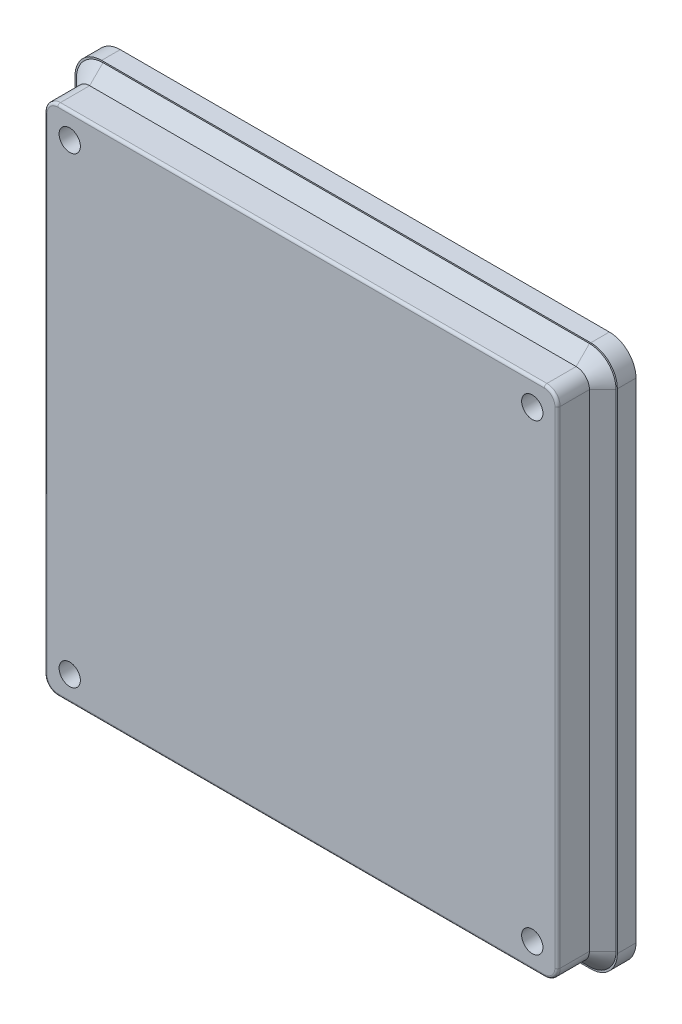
from build123d import *

# Parameters (mm, degrees)
SKETCH1_W               = 204
SKETCH1_H               = 204
BOSS_EXTRUDE1_DEPTH     = 7
SKETCH2_W               = 193
SKETCH2_H               = 193
BOSS_EXTRUDE2_DEPTH     = 17
FILLET1_R               = 5
FILLET2_R               = 10
CHAMFER1_SIZE           = 5
CUT_EXTRUDE1_DEPTH      = 5
CUT_EXTRUDE2_DEPTH      = 21
SKETCH4_R               = 2
BOSS_EXTRUDE3_DEPTH     = 5
MIRROR2_COPY_1_SKETCH_R = 2
MIRROR2_COPY_1_DEPTH    = 5
SKETCH5_R               = 1
CUT_EXTRUDE3_DEPTH      = 5
MIRROR4_COPY_1_SKETCH_R = 1
MIRROR4_COPY_1_DEPTH    = 5
SKETCH8_R               = 4
CUT_EXTRUDE6_DEPTH      = 18
SKETCH10_R              = 2
CUT_EXTRUDE7_DEPTH      = 146.368497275
FILLET3_R               = 1
MIRROR6_COPY_1_SKETCH_R = 4
MIRROR6_COPY_1_DEPTH    = 18
MIRROR6_COPY_2_SKETCH_R = 2
MIRROR6_COPY_2_DEPTH    = 146.368497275
MIRROR6_COPY_3_SKETCH_R = 2
MIRROR6_COPY_3_DEPTH    = 146.368497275


with BuildPart() as part:
    # Sketch1 → Boss-Extrude1 (new body)
    with BuildSketch(Plane.XY):
        Rectangle(SKETCH1_W, SKETCH1_H)
    extrude(amount=BOSS_EXTRUDE1_DEPTH)

    # Sketch2 → Boss-Extrude2 (add)
    with BuildSketch(Plane.XY.offset(7)):
        Rectangle(SKETCH2_W, SKETCH2_H)
    extrude(amount=BOSS_EXTRUDE2_DEPTH)

    # Fillet1
    fillet1_edges = [part.edges().sort_by_distance(p)[0] for p in [
        (96.5, -96.5, 15.5),
        (96.5, 96.5, 15.5),
        (-96.5, 96.5, 15.5),
        (-96.5, -96.5, 15.5),
    ]]
    fillet(fillet1_edges, radius=FILLET1_R)

    # Fillet2
    fillet2_edges = [part.edges().sort_by_distance(p)[0] for p in [
        (102, -102, 3.5),
        (-102, -102, 3.5),
        (-102, 102, 3.5),
        (102, 102, 3.5),
    ]]
    fillet(fillet2_edges, radius=FILLET2_R)

    # Chamfer1
    chamfer1_edges = [part.edges().sort_by_distance(p)[0] for p in [
        (96.5, 0, 7),
        (0, -96.5, 7),
        (-96.5, 0, 7),
        (0, 96.5, 7),
        (95.035533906, -95.035533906, 7),
        (-95.035533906, -95.035533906, 7),
        (-95.035533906, 95.035533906, 7),
        (95.035533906, 95.035533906, 7),
    ]]
    chamfer(chamfer1_edges, length=CHAMFER1_SIZE)

    # Sketch3 → Cut-Extrude1 (cut)
    with BuildSketch(Plane(origin=(0, 0, 0), x_dir=(-1, 0, 0), z_dir=(0, 0, -1))):
        with BuildLine():
            Line((-92, -100), (92, -100))
            ThreePointArc((92, -100), (97.656854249, -97.656854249), (100, -92))
            Line((100, -92), (100, 92))
            ThreePointArc((100, 92), (97.656854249, 97.656854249), (92, 100))
            Line((92, 100), (-92, 100))
            ThreePointArc((-92, 100), (-97.656854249, 97.656854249), (-100, 92))
            Line((-100, 92), (-100, -92))
            ThreePointArc((-100, -92), (-97.656854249, -97.656854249), (-92, -100))
        make_face()
        with BuildLine():
            ThreePointArc((-88, -79), (-81.636038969, -81.636038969), (-79, -88))
            Line((-79, -88), (-79, -97))
            Line((-79, -97), (79, -97))
            Line((79, -97), (79, -88))
            ThreePointArc((79, -88), (81.636038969, -81.636038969), (88, -79))
            Line((88, -79), (97, -79))
            Line((97, -79), (97, 79))
            Line((97, 79), (88, 79))
            ThreePointArc((88, 79), (81.636038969, 81.636038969), (79, 88))
            Line((79, 88), (79, 97))
            Line((79, 97), (-79, 97))
            Line((-79, 97), (-79, 88))
            ThreePointArc((-79, 88), (-81.636038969, 81.636038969), (-88, 79))
            Line((-88, 79), (-97, 79))
            Line((-97, 79), (-97, -79))
            Line((-97, -79), (-88, -79))
        make_face(mode=Mode.SUBTRACT)
    extrude(amount=-CUT_EXTRUDE1_DEPTH, mode=Mode.SUBTRACT)

    # Sketch3_3 → Cut-Extrude2 (cut)
    with BuildSketch(Plane(origin=(0, 0, 0), x_dir=(-1, 0, 0), z_dir=(0, 0, -1))):
        with BuildLine():
            Line((-88, -78), (-96, -78))
            Line((-96, -78), (-96, 78))
            Line((-96, 78), (-88, 78))
            ThreePointArc((-88, 78), (-80.928932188, 80.928932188), (-78, 88))
            Line((-78, 88), (-78, 96))
            Line((-78, 96), (78, 96))
            Line((78, 96), (78, 88))
            ThreePointArc((78, 88), (80.928932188, 80.928932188), (88, 78))
            Line((88, 78), (96, 78))
            Line((96, 78), (96, -78))
            Line((96, -78), (88, -78))
            ThreePointArc((88, -78), (80.928932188, -80.928932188), (78, -88))
            Line((78, -88), (78, -96))
            Line((78, -96), (-78, -96))
            Line((-78, -96), (-78, -88))
            ThreePointArc((-78, -88), (-80.928932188, -80.928932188), (-88, -78))
        make_face()
    extrude(amount=-CUT_EXTRUDE2_DEPTH, mode=Mode.SUBTRACT)

    # Sketch4 → Boss-Extrude3 (add)
    with BuildSketch(Plane(origin=(0, 0, 5), x_dir=(-1, 0, 0), z_dir=(0, 0, -1))):
        with BuildLine():
            Line((-96, 91), (-96, 83))
            Line((-96, 83), (-87, 83))
            ThreePointArc((-87, 83), (-84.171572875, 84.171572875), (-83, 87))
            Line((-83, 87), (-83, 96))
            Line((-83, 96), (-91, 96))
            ThreePointArc((-91, 96), (-94.535533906, 94.535533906), (-96, 91))
        make_face()
        with Locations(Location((-87, 87, 0), (0, 0, 180))):
            Circle(SKETCH4_R, mode=Mode.SUBTRACT)
    boss_extrude3 = extrude(amount=BOSS_EXTRUDE3_DEPTH)

    # Mirror1: Boss-Extrude3 across plane
    add(boss_extrude3.mirror(Plane(origin=(0, 0, 0), x_dir=(0, 0, 1), z_dir=(1, 0, 0))))

    # Mirror2: Boss-Extrude3 across plane
    add(boss_extrude3.mirror(Plane.ZX))

    # Mirror2 copy 1 sketch → Mirror2 copy 1 (add)
    with BuildSketch(Plane(origin=(0, 0, 5), x_dir=(1, 0, 0), z_dir=(0, 0, -1))):
        with BuildLine():
            Line((-96, 91), (-96, 83))
            Line((-96, 83), (-87, 83))
            ThreePointArc((-87, 83), (-84.171572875, 84.171572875), (-83, 87))
            Line((-83, 87), (-83, 96))
            Line((-83, 96), (-91, 96))
            ThreePointArc((-91, 96), (-94.535533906, 94.535533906), (-96, 91))
        make_face()
        with Locations(Location((-87, 87, 0), (0, 0, 180))):
            Circle(MIRROR2_COPY_1_SKETCH_R, mode=Mode.SUBTRACT)
    extrude(amount=MIRROR2_COPY_1_DEPTH)

    # Sketch5 → Cut-Extrude3 (cut)
    with BuildSketch(Plane(origin=(0, 0, 5), x_dir=(-1, 0, 0), z_dir=(0, 0, -1))):
        with Locations((-81, 95)):
            Circle(SKETCH5_R)
        with Locations((-95, 81)):
            Circle(SKETCH5_R)
    cut_extrude3 = extrude(amount=-CUT_EXTRUDE3_DEPTH, mode=Mode.SUBTRACT)

    # Mirror3: Cut-Extrude3 across plane
    add(cut_extrude3.mirror(Plane(origin=(0, 0, 0), x_dir=(0, 0, 1), z_dir=(1, 0, 0))), mode=Mode.SUBTRACT)

    # Mirror4: Cut-Extrude3 across plane
    add(cut_extrude3.mirror(Plane.ZX), mode=Mode.SUBTRACT)

    # Mirror4 copy 1 sketch → Mirror4 copy 1 (cut)
    with BuildSketch(Plane(origin=(0, 0, 5), x_dir=(1, 0, 0), z_dir=(0, 0, -1))):
        with Locations((-81, 95)):
            Circle(MIRROR4_COPY_1_SKETCH_R)
        with Locations((-95, 81)):
            Circle(MIRROR4_COPY_1_SKETCH_R)
    extrude(amount=-MIRROR4_COPY_1_DEPTH, mode=Mode.SUBTRACT)

    # Sketch8 → Cut-Extrude6 (cut)
    with BuildSketch(Plane.XY.offset(24)):
        with Locations((-87, 87)):
            Circle(SKETCH8_R)
    cut_extrude6 = extrude(amount=-CUT_EXTRUDE6_DEPTH, mode=Mode.SUBTRACT)

    # Sketch10 → Cut-Extrude7 (cut, through all)
    with BuildSketch(Plane.XY.offset(6)):
        with Locations((-87, 87)):
            Circle(SKETCH10_R)
    cut_extrude7 = extrude(amount=-CUT_EXTRUDE7_DEPTH, mode=Mode.SUBTRACT)

    # Fillet3
    fillet3_edges = [part.edges().sort_by_distance(p)[0] for p in [
        (96.5, 0, 24),
        (0, -96.5, 24),
        (0, 96.5, 24),
        (-96.5, 0, 24),
        (95.035533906, 95.035533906, 24),
        (-95.035533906, 95.035533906, 24),
        (-95.035533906, -95.035533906, 24),
        (95.035533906, -95.035533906, 24),
    ]]
    fillet(fillet3_edges, radius=FILLET3_R)

    # Mirror5: Cut-Extrude6, Cut-Extrude7 across plane
    add(cut_extrude6.mirror(Plane.ZX), mode=Mode.SUBTRACT)
    add(cut_extrude7.mirror(Plane.ZX), mode=Mode.SUBTRACT)

    # Mirror6: Cut-Extrude6 across plane
    add(cut_extrude6.mirror(Plane(origin=(0, 0, 0), x_dir=(0, 0, 1), z_dir=(1, 0, 0))), mode=Mode.SUBTRACT)

    # Mirror6 copy 1 sketch → Mirror6 copy 1 (cut)
    with BuildSketch(Plane(origin=(0, 0, 24), x_dir=(-1, 0, 0), z_dir=(0, 0, 1))):
        with Locations((-87, 87)):
            Circle(MIRROR6_COPY_1_SKETCH_R)
    extrude(amount=-MIRROR6_COPY_1_DEPTH, mode=Mode.SUBTRACT)

    # Mirror6 copy 2 sketch → Mirror6 copy 2 (cut, through all)
    with BuildSketch(Plane(origin=(0, 0, 6), x_dir=(-1, 0, 0), z_dir=(0, 0, 1))):
        with Locations((-87, 87)):
            Circle(MIRROR6_COPY_2_SKETCH_R)
    extrude(amount=-MIRROR6_COPY_2_DEPTH, mode=Mode.SUBTRACT)

    # Mirror6 copy 3 sketch → Mirror6 copy 3 (cut, through all)
    with BuildSketch(Plane(origin=(0, 0, 6), x_dir=(-1, 0, 0), z_dir=(0, 0, 1))):
        with Locations((-87, -87)):
            Circle(MIRROR6_COPY_3_SKETCH_R)
    extrude(amount=-MIRROR6_COPY_3_DEPTH, mode=Mode.SUBTRACT)


solid = part.part
